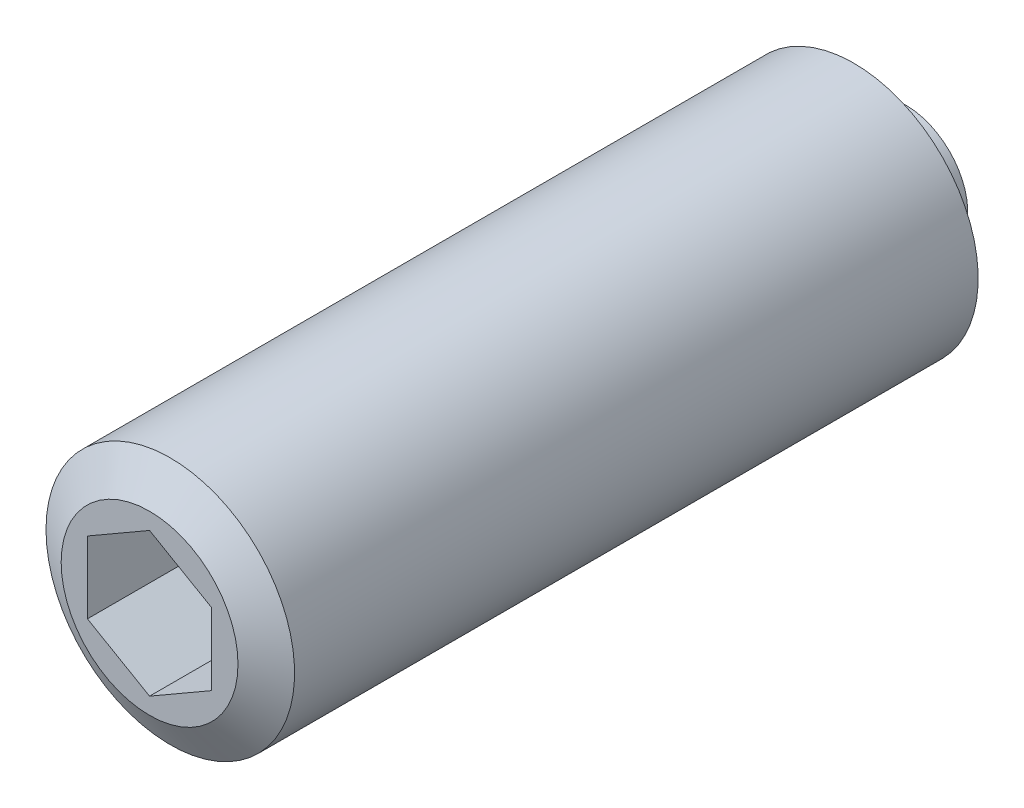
ISO-10303-21;
HEADER;
FILE_DESCRIPTION(('STEP AP214'),'2;1');
FILE_NAME('part.step','',(''),(''),'','','');
FILE_SCHEMA(('AUTOMOTIVE_DESIGN { 1 0 10303 214 1 1 1 1 }'));
ENDSEC;
DATA;
#1=APPLICATION_CONTEXT('core data for automotive mechanical design processes');
#2=APPLICATION_PROTOCOL_DEFINITION('international standard','automotive_design',2000,#1);
#3=PRODUCT_CONTEXT('',#1,'mechanical');
#4=PRODUCT('Part','Part','',(#3));
#5=PRODUCT_RELATED_PRODUCT_CATEGORY('part','',(#4));
#6=PRODUCT_DEFINITION_FORMATION('','',#4);
#7=PRODUCT_DEFINITION_CONTEXT('part definition',#1,'design');
#8=PRODUCT_DEFINITION('design','',#6,#7);
#9=PRODUCT_DEFINITION_SHAPE('','',#8);
#10=(LENGTH_UNIT() NAMED_UNIT(*) SI_UNIT(.MILLI.,.METRE.));
#11=(NAMED_UNIT(*) PLANE_ANGLE_UNIT() SI_UNIT($,.RADIAN.));
#12=(NAMED_UNIT(*) SI_UNIT($,.STERADIAN.) SOLID_ANGLE_UNIT());
#13=UNCERTAINTY_MEASURE_WITH_UNIT(LENGTH_MEASURE(1.E-05),#10,'distance_accuracy_value','');
#14=(GEOMETRIC_REPRESENTATION_CONTEXT(3) GLOBAL_UNCERTAINTY_ASSIGNED_CONTEXT((#13)) GLOBAL_UNIT_ASSIGNED_CONTEXT((#10,
#11,#12)) REPRESENTATION_CONTEXT('',''));
#15=CARTESIAN_POINT('',(0.,0.,0.));
#16=DIRECTION('',(0.,0.,1.));
#17=DIRECTION('',(1.,0.,0.));
#18=AXIS2_PLACEMENT_3D('',#15,#16,#17);
#19=CARTESIAN_POINT('',(0.,0.,36.5));
#20=DIRECTION('',(0.,0.,1.));
#21=DIRECTION('',(1.,0.,0.));
#22=AXIS2_PLACEMENT_3D('',#19,#20,#21);
#23=PLANE('',#22);
#24=DIRECTION('',(-0.866025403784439,0.5,0.));
#25=VECTOR('',#24,1.);
#26=CARTESIAN_POINT('',(3.,1.73205080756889,36.5));
#27=LINE('',#26,#25);
#28=CARTESIAN_POINT('',(3.,1.73205080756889,36.5));
#29=VERTEX_POINT('',#28);
#30=CARTESIAN_POINT('',(0.,3.46410161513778,36.5));
#31=VERTEX_POINT('',#30);
#32=EDGE_CURVE('E28',#29,#31,#27,.T.);
#33=ORIENTED_EDGE('',*,*,#32,.F.);
#34=DIRECTION('',(0.,1.,0.));
#35=VECTOR('',#34,1.);
#36=CARTESIAN_POINT('',(3.,-1.73205080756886,36.5));
#37=LINE('',#36,#35);
#38=CARTESIAN_POINT('',(3.,-1.73205080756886,36.5));
#39=VERTEX_POINT('',#38);
#40=EDGE_CURVE('E111',#39,#29,#37,.T.);
#41=ORIENTED_EDGE('',*,*,#40,.F.);
#42=DIRECTION('',(0.866025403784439,0.5,0.));
#43=VECTOR('',#42,1.);
#44=CARTESIAN_POINT('',(0.,-3.46410161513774,36.5));
#45=LINE('',#44,#43);
#46=CARTESIAN_POINT('',(0.,-3.46410161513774,36.5));
#47=VERTEX_POINT('',#46);
#48=EDGE_CURVE('E109',#47,#39,#45,.T.);
#49=ORIENTED_EDGE('',*,*,#48,.F.);
#50=DIRECTION('',(0.866025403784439,-0.5,0.));
#51=VECTOR('',#50,1.);
#52=CARTESIAN_POINT('',(-3.,-1.73205080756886,36.5));
#53=LINE('',#52,#51);
#54=CARTESIAN_POINT('',(-3.,-1.73205080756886,36.5));
#55=VERTEX_POINT('',#54);
#56=EDGE_CURVE('E76',#55,#47,#53,.T.);
#57=ORIENTED_EDGE('',*,*,#56,.F.);
#58=DIRECTION('',(0.,-1.,0.));
#59=VECTOR('',#58,1.);
#60=CARTESIAN_POINT('',(-3.,1.73205080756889,36.5));
#61=LINE('',#60,#59);
#62=CARTESIAN_POINT('',(-3.,1.73205080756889,36.5));
#63=VERTEX_POINT('',#62);
#64=EDGE_CURVE('E105',#63,#55,#61,.T.);
#65=ORIENTED_EDGE('',*,*,#64,.F.);
#66=DIRECTION('',(-0.866025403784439,-0.5,0.));
#67=VECTOR('',#66,1.);
#68=CARTESIAN_POINT('',(0.,3.46410161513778,36.5));
#69=LINE('',#68,#67);
#70=EDGE_CURVE('E102',#31,#63,#69,.T.);
#71=ORIENTED_EDGE('',*,*,#70,.F.);
#72=EDGE_LOOP('',(#33,#41,#49,#57,#65,#71));
#73=FACE_BOUND('',#72,.T.);
#74=CARTESIAN_POINT('',(0.,0.,36.5));
#75=DIRECTION('',(0.,0.,-1.));
#76=DIRECTION('',(-1.,0.,0.));
#77=AXIS2_PLACEMENT_3D('',#74,#75,#76);
#78=CIRCLE('',#77,4.267949);
#79=CARTESIAN_POINT('',(-4.267949,0.,36.5));
#80=VERTEX_POINT('',#79);
#81=EDGE_CURVE('E9',#80,#80,#78,.T.);
#82=ORIENTED_EDGE('',*,*,#81,.F.);
#83=EDGE_LOOP('',(#82));
#84=FACE_BOUND('',#83,.T.);
#85=ADVANCED_FACE('F14',(#73,#84),#23,.T.);
#86=CARTESIAN_POINT('',(0.,0.,35.5));
#87=DIRECTION('',(0.,0.,-1.));
#88=DIRECTION('',(-1.,0.,0.));
#89=AXIS2_PLACEMENT_3D('',#86,#87,#88);
#90=CONICAL_SURFACE('',#89,6.,1.04719759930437);
#91=ORIENTED_EDGE('',*,*,#81,.T.);
#92=EDGE_LOOP('',(#91));
#93=FACE_BOUND('',#92,.T.);
#94=CARTESIAN_POINT('',(0.,0.,35.5));
#95=DIRECTION('',(0.,0.,-1.));
#96=DIRECTION('',(-1.,0.,0.));
#97=AXIS2_PLACEMENT_3D('',#94,#95,#96);
#98=CIRCLE('',#97,6.);
#99=CARTESIAN_POINT('',(-6.,0.,35.5));
#100=VERTEX_POINT('',#99);
#101=EDGE_CURVE('E21',#100,#100,#98,.T.);
#102=ORIENTED_EDGE('',*,*,#101,.F.);
#103=EDGE_LOOP('',(#102));
#104=FACE_BOUND('',#103,.T.);
#105=ADVANCED_FACE('F137',(#93,#104),#90,.T.);
#106=CARTESIAN_POINT('',(0.,0.,-2.));
#107=DIRECTION('',(0.,0.,-1.));
#108=DIRECTION('',(-1.,0.,0.));
#109=AXIS2_PLACEMENT_3D('',#106,#107,#108);
#110=CYLINDRICAL_SURFACE('',#109,6.);
#111=ORIENTED_EDGE('',*,*,#101,.T.);
#112=EDGE_LOOP('',(#111));
#113=FACE_BOUND('',#112,.T.);
#114=CARTESIAN_POINT('',(0.,0.,2.5));
#115=DIRECTION('',(0.,0.,-1.));
#116=DIRECTION('',(-1.,0.,0.));
#117=AXIS2_PLACEMENT_3D('',#114,#115,#116);
#118=CIRCLE('',#117,6.);
#119=CARTESIAN_POINT('',(-6.,0.,2.5));
#120=VERTEX_POINT('',#119);
#121=EDGE_CURVE('E129',#120,#120,#118,.T.);
#122=ORIENTED_EDGE('',*,*,#121,.F.);
#123=EDGE_LOOP('',(#122));
#124=FACE_BOUND('',#123,.T.);
#125=ADVANCED_FACE('F134',(#113,#124),#110,.T.);
#126=CARTESIAN_POINT('',(0.,0.,1.5));
#127=DIRECTION('',(0.,0.,1.));
#128=DIRECTION('',(1.,0.,0.));
#129=AXIS2_PLACEMENT_3D('',#126,#127,#128);
#130=CONICAL_SURFACE('',#129,4.267949,1.04719759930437);
#131=ORIENTED_EDGE('',*,*,#121,.T.);
#132=EDGE_LOOP('',(#131));
#133=FACE_BOUND('',#132,.T.);
#134=CARTESIAN_POINT('',(0.,0.,1.5));
#135=DIRECTION('',(0.,0.,-1.));
#136=DIRECTION('',(-1.,0.,0.));
#137=AXIS2_PLACEMENT_3D('',#134,#135,#136);
#138=CIRCLE('',#137,4.267949);
#139=CARTESIAN_POINT('',(-4.267949,0.,1.5));
#140=VERTEX_POINT('',#139);
#141=EDGE_CURVE('E126',#140,#140,#138,.T.);
#142=ORIENTED_EDGE('',*,*,#141,.F.);
#143=EDGE_LOOP('',(#142));
#144=FACE_BOUND('',#143,.T.);
#145=ADVANCED_FACE('F146',(#133,#144),#130,.T.);
#146=CARTESIAN_POINT('',(0.,3.,1.5));
#147=DIRECTION('',(0.,0.,-1.));
#148=DIRECTION('',(-1.,0.,0.));
#149=AXIS2_PLACEMENT_3D('',#146,#147,#148);
#150=PLANE('',#149);
#151=ORIENTED_EDGE('',*,*,#141,.T.);
#152=EDGE_LOOP('',(#151));
#153=FACE_BOUND('',#152,.T.);
#154=CARTESIAN_POINT('',(0.,0.,1.5));
#155=DIRECTION('',(0.,0.,-1.));
#156=DIRECTION('',(-1.,0.,0.));
#157=AXIS2_PLACEMENT_3D('',#154,#155,#156);
#158=CIRCLE('',#157,3.);
#159=CARTESIAN_POINT('',(-3.,0.,1.5));
#160=VERTEX_POINT('',#159);
#161=EDGE_CURVE('E123',#160,#160,#158,.T.);
#162=ORIENTED_EDGE('',*,*,#161,.F.);
#163=EDGE_LOOP('',(#162));
#164=FACE_BOUND('',#163,.T.);
#165=ADVANCED_FACE('F152',(#153,#164),#150,.T.);
#166=CARTESIAN_POINT('',(0.,0.,-2.));
#167=DIRECTION('',(0.,0.,-1.));
#168=DIRECTION('',(-1.,0.,0.));
#169=AXIS2_PLACEMENT_3D('',#166,#167,#168);
#170=CYLINDRICAL_SURFACE('',#169,3.);
#171=ORIENTED_EDGE('',*,*,#161,.T.);
#172=EDGE_LOOP('',(#171));
#173=FACE_BOUND('',#172,.T.);
#174=CARTESIAN_POINT('',(0.,0.,0.));
#175=DIRECTION('',(0.,0.,-1.));
#176=DIRECTION('',(-1.,0.,0.));
#177=AXIS2_PLACEMENT_3D('',#174,#175,#176);
#178=CIRCLE('',#177,3.);
#179=CARTESIAN_POINT('',(-3.,0.,0.));
#180=VERTEX_POINT('',#179);
#181=EDGE_CURVE('E115',#180,#180,#178,.T.);
#182=ORIENTED_EDGE('',*,*,#181,.F.);
#183=EDGE_LOOP('',(#182));
#184=FACE_BOUND('',#183,.T.);
#185=ADVANCED_FACE('F156',(#173,#184),#170,.T.);
#186=CARTESIAN_POINT('',(0.,0.,0.));
#187=DIRECTION('',(0.,0.,-1.));
#188=DIRECTION('',(-1.,0.,0.));
#189=AXIS2_PLACEMENT_3D('',#186,#187,#188);
#190=PLANE('',#189);
#191=ORIENTED_EDGE('',*,*,#181,.T.);
#192=EDGE_LOOP('',(#191));
#193=FACE_BOUND('',#192,.T.);
#194=ADVANCED_FACE('F160',(#193),#190,.T.);
#195=CARTESIAN_POINT('',(3.,1.73205080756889,31.5));
#196=DIRECTION('',(0.5,0.866025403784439,0.));
#197=DIRECTION('',(-0.866025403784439,0.5,0.));
#198=AXIS2_PLACEMENT_3D('',#195,#196,#197);
#199=PLANE('',#198);
#200=ORIENTED_EDGE('',*,*,#32,.T.);
#201=DIRECTION('',(0.,0.,1.));
#202=VECTOR('',#201,1.);
#203=CARTESIAN_POINT('',(0.,3.46410161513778,31.5));
#204=LINE('',#203,#202);
#205=CARTESIAN_POINT('',(0.,3.46410161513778,31.5));
#206=VERTEX_POINT('',#205);
#207=EDGE_CURVE('E58',#206,#31,#204,.T.);
#208=ORIENTED_EDGE('',*,*,#207,.F.);
#209=DIRECTION('',(-0.866025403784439,0.5,0.));
#210=VECTOR('',#209,1.);
#211=CARTESIAN_POINT('',(3.,1.73205080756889,31.5));
#212=LINE('',#211,#210);
#213=CARTESIAN_POINT('',(3.,1.73205080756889,31.5));
#214=VERTEX_POINT('',#213);
#215=EDGE_CURVE('E113',#214,#206,#212,.T.);
#216=ORIENTED_EDGE('',*,*,#215,.F.);
#217=DIRECTION('',(0.,0.,1.));
#218=VECTOR('',#217,1.);
#219=CARTESIAN_POINT('',(3.,1.73205080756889,31.5));
#220=LINE('',#219,#218);
#221=EDGE_CURVE('E36',#214,#29,#220,.T.);
#222=ORIENTED_EDGE('',*,*,#221,.T.);
#223=EDGE_LOOP('',(#200,#208,#216,#222));
#224=FACE_BOUND('',#223,.T.);
#225=ADVANCED_FACE('F164',(#224),#199,.F.);
#226=CARTESIAN_POINT('',(3.,-1.73205080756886,31.5));
#227=DIRECTION('',(1.,0.,0.));
#228=DIRECTION('',(0.,0.,-1.));
#229=AXIS2_PLACEMENT_3D('',#226,#227,#228);
#230=PLANE('',#229);
#231=ORIENTED_EDGE('',*,*,#40,.T.);
#232=ORIENTED_EDGE('',*,*,#221,.F.);
#233=DIRECTION('',(0.,1.,0.));
#234=VECTOR('',#233,1.);
#235=CARTESIAN_POINT('',(3.,-1.73205080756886,31.5));
#236=LINE('',#235,#234);
#237=CARTESIAN_POINT('',(3.,-1.73205080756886,31.5));
#238=VERTEX_POINT('',#237);
#239=EDGE_CURVE('E88',#238,#214,#236,.T.);
#240=ORIENTED_EDGE('',*,*,#239,.F.);
#241=DIRECTION('',(0.,0.,1.));
#242=VECTOR('',#241,1.);
#243=CARTESIAN_POINT('',(3.,-1.73205080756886,31.5));
#244=LINE('',#243,#242);
#245=EDGE_CURVE('E80',#238,#39,#244,.T.);
#246=ORIENTED_EDGE('',*,*,#245,.T.);
#247=EDGE_LOOP('',(#231,#232,#240,#246));
#248=FACE_BOUND('',#247,.T.);
#249=ADVANCED_FACE('F168',(#248),#230,.F.);
#250=CARTESIAN_POINT('',(0.,-3.46410161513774,31.5));
#251=DIRECTION('',(0.5,-0.866025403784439,0.));
#252=DIRECTION('',(0.866025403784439,0.5,0.));
#253=AXIS2_PLACEMENT_3D('',#250,#251,#252);
#254=PLANE('',#253);
#255=ORIENTED_EDGE('',*,*,#48,.T.);
#256=ORIENTED_EDGE('',*,*,#245,.F.);
#257=DIRECTION('',(0.866025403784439,0.5,0.));
#258=VECTOR('',#257,1.);
#259=CARTESIAN_POINT('',(0.,-3.46410161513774,31.5));
#260=LINE('',#259,#258);
#261=CARTESIAN_POINT('',(0.,-3.46410161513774,31.5));
#262=VERTEX_POINT('',#261);
#263=EDGE_CURVE('E84',#262,#238,#260,.T.);
#264=ORIENTED_EDGE('',*,*,#263,.F.);
#265=DIRECTION('',(0.,0.,1.));
#266=VECTOR('',#265,1.);
#267=CARTESIAN_POINT('',(0.,-3.46410161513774,31.5));
#268=LINE('',#267,#266);
#269=EDGE_CURVE('E69',#262,#47,#268,.T.);
#270=ORIENTED_EDGE('',*,*,#269,.T.);
#271=EDGE_LOOP('',(#255,#256,#264,#270));
#272=FACE_BOUND('',#271,.T.);
#273=ADVANCED_FACE('F85',(#272),#254,.F.);
#274=CARTESIAN_POINT('',(-3.,-1.73205080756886,31.5));
#275=DIRECTION('',(-0.5,-0.866025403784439,0.));
#276=DIRECTION('',(0.866025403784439,-0.5,0.));
#277=AXIS2_PLACEMENT_3D('',#274,#275,#276);
#278=PLANE('',#277);
#279=ORIENTED_EDGE('',*,*,#56,.T.);
#280=ORIENTED_EDGE('',*,*,#269,.F.);
#281=DIRECTION('',(0.866025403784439,-0.5,0.));
#282=VECTOR('',#281,1.);
#283=CARTESIAN_POINT('',(-3.,-1.73205080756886,31.5));
#284=LINE('',#283,#282);
#285=CARTESIAN_POINT('',(-3.,-1.73205080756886,31.5));
#286=VERTEX_POINT('',#285);
#287=EDGE_CURVE('E73',#286,#262,#284,.T.);
#288=ORIENTED_EDGE('',*,*,#287,.F.);
#289=DIRECTION('',(0.,0.,1.));
#290=VECTOR('',#289,1.);
#291=CARTESIAN_POINT('',(-3.,-1.73205080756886,31.5));
#292=LINE('',#291,#290);
#293=EDGE_CURVE('E81',#286,#55,#292,.T.);
#294=ORIENTED_EDGE('',*,*,#293,.T.);
#295=EDGE_LOOP('',(#279,#280,#288,#294));
#296=FACE_BOUND('',#295,.T.);
#297=ADVANCED_FACE('F71',(#296),#278,.F.);
#298=CARTESIAN_POINT('',(-3.,1.73205080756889,31.5));
#299=DIRECTION('',(-1.,0.,0.));
#300=DIRECTION('',(0.,0.,1.));
#301=AXIS2_PLACEMENT_3D('',#298,#299,#300);
#302=PLANE('',#301);
#303=ORIENTED_EDGE('',*,*,#64,.T.);
#304=ORIENTED_EDGE('',*,*,#293,.F.);
#305=DIRECTION('',(0.,-1.,0.));
#306=VECTOR('',#305,1.);
#307=CARTESIAN_POINT('',(-3.,1.73205080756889,31.5));
#308=LINE('',#307,#306);
#309=CARTESIAN_POINT('',(-3.,1.73205080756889,31.5));
#310=VERTEX_POINT('',#309);
#311=EDGE_CURVE('E94',#310,#286,#308,.T.);
#312=ORIENTED_EDGE('',*,*,#311,.F.);
#313=DIRECTION('',(0.,0.,1.));
#314=VECTOR('',#313,1.);
#315=CARTESIAN_POINT('',(-3.,1.73205080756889,31.5));
#316=LINE('',#315,#314);
#317=EDGE_CURVE('E118',#310,#63,#316,.T.);
#318=ORIENTED_EDGE('',*,*,#317,.T.);
#319=EDGE_LOOP('',(#303,#304,#312,#318));
#320=FACE_BOUND('',#319,.T.);
#321=ADVANCED_FACE('F172',(#320),#302,.F.);
#322=CARTESIAN_POINT('',(0.,3.46410161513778,31.5));
#323=DIRECTION('',(-0.5,0.866025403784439,0.));
#324=DIRECTION('',(-0.866025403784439,-0.5,0.));
#325=AXIS2_PLACEMENT_3D('',#322,#323,#324);
#326=PLANE('',#325);
#327=ORIENTED_EDGE('',*,*,#70,.T.);
#328=ORIENTED_EDGE('',*,*,#317,.F.);
#329=DIRECTION('',(-0.866025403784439,-0.5,0.));
#330=VECTOR('',#329,1.);
#331=CARTESIAN_POINT('',(0.,3.46410161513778,31.5));
#332=LINE('',#331,#330);
#333=EDGE_CURVE('E96',#206,#310,#332,.T.);
#334=ORIENTED_EDGE('',*,*,#333,.F.);
#335=ORIENTED_EDGE('',*,*,#207,.T.);
#336=EDGE_LOOP('',(#327,#328,#334,#335));
#337=FACE_BOUND('',#336,.T.);
#338=ADVANCED_FACE('F169',(#337),#326,.F.);
#339=CARTESIAN_POINT('',(0.,3.46410161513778,31.5));
#340=DIRECTION('',(0.,0.,1.));
#341=DIRECTION('',(1.,0.,0.));
#342=AXIS2_PLACEMENT_3D('',#339,#340,#341);
#343=PLANE('',#342);
#344=ORIENTED_EDGE('',*,*,#215,.T.);
#345=ORIENTED_EDGE('',*,*,#333,.T.);
#346=ORIENTED_EDGE('',*,*,#311,.T.);
#347=ORIENTED_EDGE('',*,*,#287,.T.);
#348=ORIENTED_EDGE('',*,*,#263,.T.);
#349=ORIENTED_EDGE('',*,*,#239,.T.);
#350=EDGE_LOOP('',(#344,#345,#346,#347,#348,#349));
#351=FACE_BOUND('',#350,.T.);
#352=ADVANCED_FACE('F91',(#351),#343,.T.);
#353=CLOSED_SHELL('',(#85,#105,#125,#145,#165,#185,#194,#225,#249,#273,#297,#321,#338,#352));
#354=MANIFOLD_SOLID_BREP('B1',#353);
#355=ADVANCED_BREP_SHAPE_REPRESENTATION('',(#18,#354),#14);
#356=SHAPE_DEFINITION_REPRESENTATION(#9,#355);
ENDSEC;
END-ISO-10303-21;
